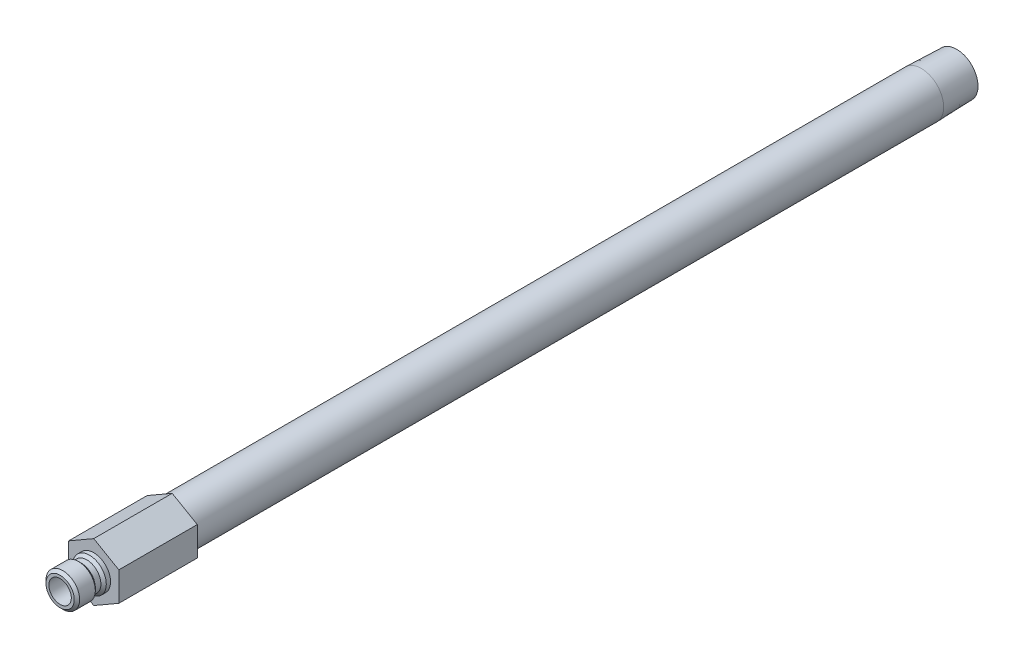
from build123d import *

# Parameters (mm, degrees)
SKETCH2_R           = 3.175
BOSS_EXTRUDE1_DEPTH = 22.225


with BuildPart() as part:
    # Sketch1 → Revolve1 (revolve)
    with BuildSketch(Plane(origin=(0, 0, 0), x_dir=(0, 0, -1), z_dir=(1, 0, 0))):
        Polygon((-9.525, 3.175), (-9.525, 4.0005), (-8.763, 4.7625), (-4.318, 4.7625), (-3.556, 4.0005), (-1.9685, 4.0005), (-1.2065, 4.7625), (0, 4.7625), (0, 6.35), (234.442, 6.35), (244.475, 6.036470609), (244.475, 4.6228), (22.225, 4.6228), (22.225, 3.175), align=None)
    revolve(axis=Axis((0, 0, 0), (0, 0, 1)))

    # Sketch2 → Boss-Extrude1 (add)
    with BuildSketch(Plane.XY):
        Polygon((-7.112, 4.106115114), (-7.112, -4.106115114), (0, -8.212230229), (7.112, -4.106115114), (7.112, 4.106115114), (0, 8.212230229), align=None)
        with Locations(Location((0, 0, 0), (0, 0, 90))):
            Circle(SKETCH2_R, mode=Mode.SUBTRACT)
    extrude(amount=-BOSS_EXTRUDE1_DEPTH)


solid = part.part
